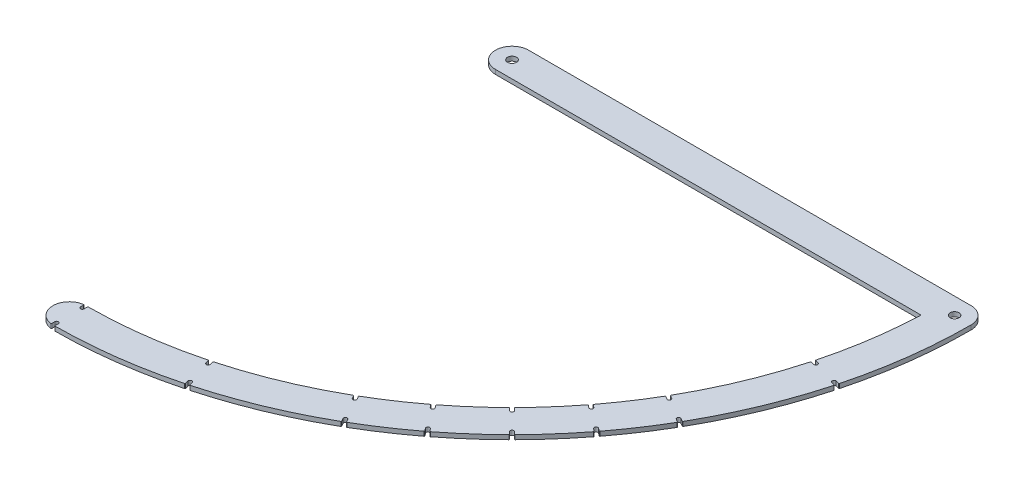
from build123d import *

# Parameters (mm, degrees)
SCHIZZO2_R                   = 4
SCHIZZO2_R_2                 = 4.05
ESTRUSIONE_ESTRUSIONE1_DEPTH = 4


with BuildPart() as part:
    # Schizzo2 → Estrusione-Estrusione1 (new body)
    with BuildSketch(Plane(origin=(0, 0, 0), x_dir=(1, 0, 0), z_dir=(0, 1, 0))):
        with BuildLine():
            Line((1854.311658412, 1925.370149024), (2254.311658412, 1925.370149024))
            ThreePointArc((2254.311658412, 1925.370149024), (2264.91826013, 1920.976750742), (2269.311658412, 1910.370149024))
            ThreePointArc((2269.311658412, 1910.370149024), (2265.897174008, 1857.244229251), (2255.70990732, 1804.992514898))
            ThreePointArc((2255.70990732, 1804.992514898), (2255.477391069, 1804.687097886), (2255.096885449, 1804.63651299))
            Line((2255.096885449, 1804.63651299), (2252.298211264, 1805.386415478))
            ThreePointArc((2252.298211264, 1805.386415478), (2250.33861947, 1804.255044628), (2251.46999032, 1802.295452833))
            Line((2251.46999032, 1802.295452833), (2254.268664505, 1801.545550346))
            ThreePointArc((2254.268664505, 1801.545550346), (2254.57289959, 1801.311489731), (2254.621556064, 1800.930732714))
            ThreePointArc((2254.621556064, 1800.930732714), (2237.721664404, 1751.556524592), (2214.758855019, 1704.69365922))
            ThreePointArc((2214.758855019, 1704.69365922), (2214.455213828, 1704.458828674), (2214.074581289, 1704.508449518))
            Line((2214.074581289, 1704.508449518), (2211.56535866, 1705.957149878))
            ThreePointArc((2211.56535866, 1705.957149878), (2209.379718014, 1705.371509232), (2209.96535866, 1703.185868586))
            Line((2209.96535866, 1703.185868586), (2212.474581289, 1701.737168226))
            ThreePointArc((2212.474581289, 1701.737168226), (2212.70787047, 1701.432341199), (2212.656321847, 1701.051964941))
            ThreePointArc((2212.656321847, 1701.051964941), (2199.371547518, 1679.808502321), (2184.829010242, 1659.405450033))
            ThreePointArc((2184.829010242, 1659.405450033), (2184.497315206, 1659.212261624), (2184.12641585, 1659.31114047))
            Line((2184.12641585, 1659.31114047), (2181.827753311, 1661.074966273))
            ThreePointArc((2181.827753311, 1661.074966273), (2179.58436968, 1660.779619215), (2179.879716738, 1658.536235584))
            Line((2179.879716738, 1658.536235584), (2182.178379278, 1656.772409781))
            ThreePointArc((2182.178379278, 1656.772409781), (2182.369884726, 1656.439740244), (2182.269128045, 1656.069346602))
            ThreePointArc((2182.269128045, 1656.069346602), (2166.325178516, 1636.741635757), (2149.243921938, 1618.411316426))
            ThreePointArc((2149.243921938, 1618.411316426), (2148.889848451, 1618.26307566), (2148.53502847, 1618.409520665))
            Line((2148.53502847, 1618.409520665), (2146.486256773, 1620.458292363))
            ThreePointArc((2146.486256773, 1620.458292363), (2144.223515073, 1620.458292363), (2144.223515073, 1618.195550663))
            Line((2144.223515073, 1618.195550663), (2146.272286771, 1616.146778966))
            ThreePointArc((2146.272286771, 1616.146778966), (2146.418731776, 1615.791958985), (2146.27049101, 1615.437885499))
            ThreePointArc((2146.27049101, 1615.437885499), (2127.940171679, 1598.35662892), (2108.612460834, 1582.412679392))
            ThreePointArc((2108.612460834, 1582.412679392), (2108.242067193, 1582.31192271), (2107.909397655, 1582.503428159))
            Line((2107.909397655, 1582.503428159), (2106.145571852, 1584.802090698))
            ThreePointArc((2106.145571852, 1584.802090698), (2103.902188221, 1585.097437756), (2103.606841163, 1582.854054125))
            Line((2103.606841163, 1582.854054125), (2105.370666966, 1580.555391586))
            ThreePointArc((2105.370666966, 1580.555391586), (2105.469545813, 1580.18449223), (2105.276357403, 1579.852797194))
            ThreePointArc((2105.276357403, 1579.852797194), (2084.873305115, 1565.310259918), (2063.629842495, 1552.025485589))
            ThreePointArc((2063.629842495, 1552.025485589), (2063.249466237, 1551.973936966), (2062.94463921, 1552.207226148))
            Line((2062.94463921, 1552.207226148), (2061.49593885, 1554.716448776))
            ThreePointArc((2061.49593885, 1554.716448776), (2059.310298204, 1555.302089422), (2058.724657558, 1553.116448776))
            Line((2058.724657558, 1553.116448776), (2060.173357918, 1550.607226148))
            ThreePointArc((2060.173357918, 1550.607226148), (2060.222978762, 1550.226593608), (2059.988148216, 1549.922952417))
            ThreePointArc((2059.988148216, 1549.922952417), (2013.125282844, 1526.960143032), (1963.751074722, 1510.060251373))
            ThreePointArc((1963.751074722, 1510.060251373), (1963.370317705, 1510.108907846), (1963.13625709, 1510.413142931))
            Line((1963.13625709, 1510.413142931), (1962.386354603, 1513.211817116))
            ThreePointArc((1962.386354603, 1513.211817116), (1960.426762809, 1514.343187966), (1959.295391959, 1512.383596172))
            Line((1959.295391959, 1512.383596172), (1960.045294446, 1509.584921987))
            ThreePointArc((1960.045294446, 1509.584921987), (1959.994709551, 1509.204416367), (1959.689292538, 1508.971900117))
            ThreePointArc((1959.689292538, 1508.971900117), (1908.480028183, 1498.920531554), (1856.414191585, 1495.375475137))
            ThreePointArc((1856.414191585, 1495.375475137), (1856.05900177, 1495.52102085), (1855.911658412, 1495.87546872))
            Line((1855.911658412, 1495.87546872), (1855.911658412, 1498.772869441))
            ThreePointArc((1855.911658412, 1498.772869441), (1854.311658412, 1500.372869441), (1852.711658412, 1498.772869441))
            Line((1852.711658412, 1498.772869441), (1852.711658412, 1496.023023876))
            ThreePointArc((1852.711658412, 1496.023023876), (1852.538608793, 1495.644733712), (1852.139244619, 1495.528295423))
            ThreePointArc((1852.139244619, 1495.528295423), (1839.311658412, 1510.370149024), (1852.139244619, 1525.212002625))
            ThreePointArc((1852.139244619, 1525.212002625), (1852.538608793, 1525.095564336), (1852.711658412, 1524.717274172))
            Line((1852.711658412, 1524.717274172), (1852.711658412, 1521.967428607))
            ThreePointArc((1852.711658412, 1521.967428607), (1854.311658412, 1520.370146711), (1855.911658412, 1521.967428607))
            Line((1855.911658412, 1521.967428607), (1855.911658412, 1524.875868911))
            ThreePointArc((1855.911658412, 1524.875868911), (1856.057143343, 1525.228458), (1856.408934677, 1525.375861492))
            ThreePointArc((1856.408934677, 1525.375861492), (1904.564242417, 1528.663877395), (1951.929698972, 1537.951408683))
            ThreePointArc((1951.929698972, 1537.951408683), (1952.307654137, 1537.900078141), (1952.539438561, 1537.597157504))
            Line((1952.539438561, 1537.597157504), (1953.292198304, 1534.7878199))
            ThreePointArc((1953.292198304, 1534.7878199), (1955.251086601, 1533.659074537), (1956.383160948, 1535.616040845))
            Line((1956.383160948, 1535.616040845), (1955.630401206, 1538.425378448))
            ThreePointArc((1955.630401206, 1538.425378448), (1955.679672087, 1538.803607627), (1955.98132559, 1539.037038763))
            ThreePointArc((1955.98132559, 1539.037038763), (2001.644779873, 1554.676529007), (2044.992507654, 1575.906677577))
            ThreePointArc((2044.992507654, 1575.906677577), (2045.370869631, 1575.954918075), (2045.673157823, 1575.722309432))
            Line((2045.673157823, 1575.722309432), (2047.127377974, 1573.203526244))
            ThreePointArc((2047.127377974, 1573.203526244), (2049.311659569, 1572.620239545), (2049.898659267, 1574.803526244))
            Line((2049.898659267, 1574.803526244), (2048.444439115, 1577.322309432))
            ThreePointArc((2048.444439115, 1577.322309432), (2048.394138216, 1577.700403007), (2048.625096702, 1578.003953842))
            ThreePointArc((2048.625096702, 1578.003953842), (2068.206198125, 1590.254348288), (2087.01744992, 1603.656904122))
            ThreePointArc((2087.01744992, 1603.656904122), (2087.38627831, 1603.754118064), (2087.716341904, 1603.562955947))
            Line((2087.716341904, 1603.562955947), (2089.486888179, 1601.255535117))
            ThreePointArc((2089.486888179, 1601.255535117), (2091.73027181, 1600.960188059), (2092.025618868, 1603.20357169))
            Line((2092.025618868, 1603.20357169), (2090.255072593, 1605.510992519))
            ThreePointArc((2090.255072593, 1605.510992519), (2090.155850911, 1605.879285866), (2090.34521218, 1606.210385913))
            ThreePointArc((2090.34521218, 1606.210385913), (2108.159797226, 1620.911823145), (2125.060731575, 1636.655079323))
            ThreePointArc((2125.060731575, 1636.655079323), (2125.413715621, 1636.799603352), (2125.765907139, 1636.653158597))
            Line((2125.765907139, 1636.653158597), (2127.822485, 1634.596580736))
            ThreePointArc((2127.822485, 1634.596580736), (2130.0852267, 1634.596580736), (2130.0852267, 1636.859322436))
            Line((2130.0852267, 1636.859322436), (2128.028648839, 1638.915900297))
            ThreePointArc((2128.028648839, 1638.915900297), (2127.882204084, 1639.268091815), (2128.026728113, 1639.621075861))
            ThreePointArc((2128.026728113, 1639.621075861), (2143.769984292, 1656.52201021), (2158.471421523, 1674.336595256))
            ThreePointArc((2158.471421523, 1674.336595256), (2158.80252157, 1674.525956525), (2159.170814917, 1674.426734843))
            Line((2159.170814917, 1674.426734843), (2161.478235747, 1672.656188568))
            ThreePointArc((2161.478235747, 1672.656188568), (2163.721619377, 1672.951535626), (2163.426272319, 1675.194919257))
            Line((2163.426272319, 1675.194919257), (2161.11885149, 1676.965465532))
            ThreePointArc((2161.11885149, 1676.965465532), (2160.927689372, 1677.295529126), (2161.024903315, 1677.664357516))
            ThreePointArc((2161.024903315, 1677.664357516), (2174.427459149, 1696.475609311), (2186.677853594, 1716.056710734))
            ThreePointArc((2186.677853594, 1716.056710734), (2186.981404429, 1716.28766922), (2187.359498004, 1716.237368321))
            Line((2187.359498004, 1716.237368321), (2189.878281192, 1714.78314817))
            ThreePointArc((2189.878281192, 1714.78314817), (2192.063921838, 1715.368788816), (2191.478281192, 1717.554429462))
            Line((2191.478281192, 1717.554429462), (2188.959498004, 1719.008649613))
            ThreePointArc((2188.959498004, 1719.008649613), (2188.726889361, 1719.310937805), (2188.775129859, 1719.689299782))
            ThreePointArc((2188.775129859, 1719.689299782), (2210.005278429, 1763.037027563), (2225.644768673, 1808.700481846))
            ThreePointArc((2225.644768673, 1808.700481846), (2225.878199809, 1809.002135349), (2226.256428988, 1809.051406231))
            Line((2226.256428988, 1809.051406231), (2229.065766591, 1808.298646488))
            ThreePointArc((2229.065766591, 1808.298646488), (2231.025358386, 1809.430017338), (2229.893987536, 1811.389609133))
            Line((2229.893987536, 1811.389609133), (2227.084649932, 1812.142368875))
            ThreePointArc((2227.084649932, 1812.142368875), (2226.781729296, 1812.374153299), (2226.730398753, 1812.752108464))
            ThreePointArc((2226.730398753, 1812.752108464), (2235.1220308, 1853.726876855), (2239.019339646, 1895.370149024))
            Line((2239.019339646, 1895.370149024), (1854.311658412, 1895.370149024))
            ThreePointArc((1854.311658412, 1895.370149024), (1839.311658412, 1910.370149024), (1854.311658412, 1925.370149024))
        make_face()
        with Locations(Location((2254.311658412, 1910.370149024, 0), (0, 0, 270))):
            Circle(SCHIZZO2_R, mode=Mode.SUBTRACT)
        with Locations(Location((1854.311658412, 1910.370149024, 0), (0, 0, 270))):
            Circle(SCHIZZO2_R_2, mode=Mode.SUBTRACT)
    extrude(amount=ESTRUSIONE_ESTRUSIONE1_DEPTH)


solid = part.part
